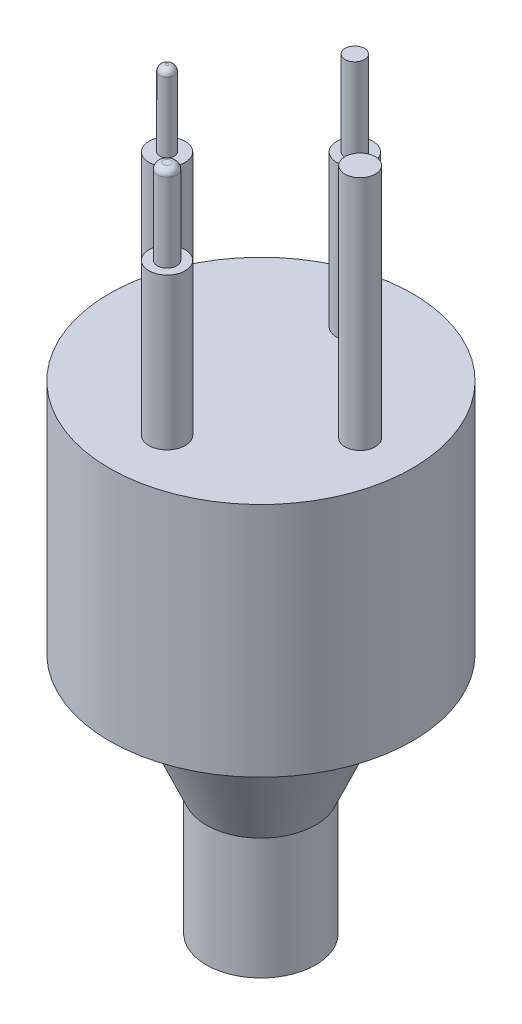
from build123d import *

# Parameters (mm, degrees)
SKETCH2_R         = 1.524
EXTRUDE1_DEPTH    = 12.7
SKETCH3_R         = 0.81382489
EXTRUDE2_DEPTH    = 7.112
FILLET1_R         = 0.508
SKETCH4_R         = 1.27
EXTRUDE3_DEPTH    = 19.812
CIRPATTERN4_COUNT = 2
CIRPATTERN4_ANGLE = 90
SKETCH5_R         = 0.616468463
EXTRUDE4_DEPTH    = 6.35
FILLET2_R         = 0.508


with BuildPart() as part:
    # Sketch1 → Revolve1 (revolve)
    with BuildSketch(Plane.XY, mode=Mode.PRIVATE) as revolve1_sk:
        Polygon((0, 0), (-4.583009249, 0), (-4.583009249, 10.16), (-9.015021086, 20.32), (-12.7, 20.32), (-12.7, 40.132), (0, 40.132), align=None)
    revolve(revolve1_sk.sketch.rotate(Axis((0, 55.728152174, 0), (0, -1, 0)), 270), axis=Axis((0, 55.728152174, 0), (0, -1, 0)))

    # Sketch2 → Extrude1 (add)
    with BuildSketch(Plane(origin=(0, 40.132, 0), x_dir=(-1, 0, 0), z_dir=(0, 1, 0))):
        with Locations(Location((0, 7.874, 0), (0, 0, 90))):
            Circle(SKETCH2_R)
    extrude1 = extrude(amount=EXTRUDE1_DEPTH)

    # Sketch3 → Extrude2 (add)
    with BuildSketch(Plane(origin=(0, 52.832, 0), x_dir=(-1, 0, 0), z_dir=(0, 1, 0))):
        with Locations(Location((0, 7.874, 0), (0, 0, 90))):
            Circle(SKETCH3_R)
    extrude2 = extrude(amount=EXTRUDE2_DEPTH)

    # Fillet1
    fillet1_edges = [part.edges().sort_by_distance(p)[0] for p in [
        (0, 59.944, 7.06017511),
    ]]
    fillet(fillet1_edges, radius=FILLET1_R)

    # Mirror1: Extrude1, Extrude2 across plane
    add(extrude1.mirror(Plane.XY))
    add(extrude2.mirror(Plane.XY))

    # Sketch4 → Extrude3 (add)
    with BuildSketch(Plane(origin=(0, 40.132, 0), x_dir=(-1, 0, 0), z_dir=(0, 1, 0))):
        with Locations(Location((-8.316893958, 0, 0), (0, 0, 90))):
            Circle(SKETCH4_R)
    extrude(amount=EXTRUDE3_DEPTH)

    # CirPattern4: Extrude1 ×2 about axis
    cirpattern4_axis = Axis((0, 55.728152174, 0), (0, -1, 0))
    for i in range(1, CIRPATTERN4_COUNT):
        add(extrude1.rotate(cirpattern4_axis, i * CIRPATTERN4_ANGLE / (CIRPATTERN4_COUNT - 1)))

    # Sketch5 → Extrude4 (add)
    with BuildSketch(Plane(origin=(0, 52.832, 0), x_dir=(-1, 0, 0), z_dir=(0, 1, 0))):
        with Locations(Location((7.874, 0, 0), (0, 0, 90))):
            Circle(SKETCH5_R)
    extrude(amount=EXTRUDE4_DEPTH)

    # Fillet2
    fillet2_edges = [part.edges().sort_by_distance(p)[0] for p in [
        (-7.874, 59.182, -0.616468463),
    ]]
    fillet(fillet2_edges, radius=FILLET2_R)


solid = part.part
